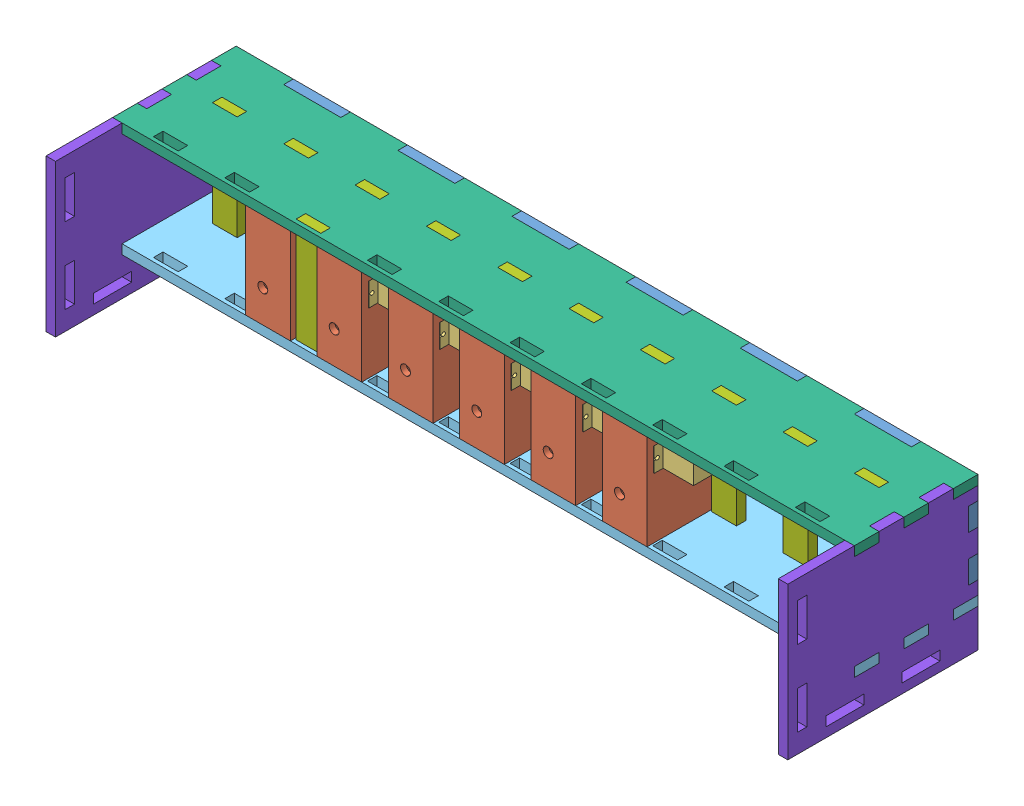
SolidWorks assembly A_SupportDistributeur.SLDASM, configuration Défaut (file format 10000). Lengths in mm.
Overall size (390 80 100).
40 component instances, 8 part files, 62 mates.
Components (placement in the parent):
- BaseSupport-1: BaseSupport.SLDPRT [Défaut] at (-173.4428 -0.6213 387.5) size (390 60 5)
- A_Distributeur-1: A_Distributeur.SLDASM [Défaut] at (-82.4428 -5.6213 392.5) x (0 0 1) z (0 -1 0) size (60 39.4 50)
  - case-2: case.SLDPRT [Défaut] at origin size (60 23.5 50)
  - servo-3: servo.SLDPRT [Predeterminado] at (40 -18.4 5.85) size (32.6 27 12.6)
  - escargot-1: escargot.SLDPRT [Défaut] at (34.8 8.6 12.15) x (0.387649 0 -0.921807) z (0.921807 0 0.387649) size (25.16 8.5 15.4)
- A_Distributeur-2: A_Distributeur.SLDASM [Défaut] at (-44.9428 -5.6213 392.5) x (0 0 1) z (0 -1 0) size (60 39.4 50)
  - case-2: case.SLDPRT [Défaut] at origin size (60 23.5 50)
  - servo-3: servo.SLDPRT [Predeterminado] at (40 -18.4 5.85) size (32.6 27 12.6)
  - escargot-1: escargot.SLDPRT [Défaut] at (34.8 8.6 12.15) x (0.387649 0 -0.921807) z (0.921807 0 0.387649) size (25.16 8.5 15.4)
- A_Distributeur-3: A_Distributeur.SLDASM [Défaut] at (-7.4428 -5.6213 392.5) x (0 0 1) z (0 -1 0) size (60 39.4 50)
  - case-2: case.SLDPRT [Défaut] at origin size (60 23.5 50)
  - servo-3: servo.SLDPRT [Predeterminado] at (40 -18.4 5.85) size (32.6 27 12.6)
  - escargot-1: escargot.SLDPRT [Défaut] at (34.8 8.6 12.15) x (0.387649 0 -0.921807) z (0.921807 0 0.387649) size (25.16 8.5 15.4)
- A_Distributeur-4: A_Distributeur.SLDASM [Défaut] at (30.0572 -5.6213 392.5) x (0 0 1) z (0 -1 0) size (60 39.4 50)
  - case-2: case.SLDPRT [Défaut] at origin size (60 23.5 50)
  - servo-3: servo.SLDPRT [Predeterminado] at (40 -18.4 5.85) size (32.6 27 12.6)
  - escargot-1: escargot.SLDPRT [Défaut] at (34.8 8.6 12.15) x (0.387649 0 -0.921807) z (0.921807 0 0.387649) size (25.16 8.5 15.4)
- A_Distributeur-5: A_Distributeur.SLDASM [Défaut] at (67.5572 -5.6213 392.5) x (0 0 1) z (0 -1 0) size (60 39.4 50)
  - case-2: case.SLDPRT [Défaut] at origin size (60 23.5 50)
  - servo-3: servo.SLDPRT [Predeterminado] at (40 -18.4 5.85) size (32.6 27 12.6)
  - escargot-1: escargot.SLDPRT [Défaut] at (34.8 8.6 12.15) x (0.387649 0 -0.921807) z (0.921807 0 0.387649) size (25.16 8.5 15.4)
- A_Distributeur-6: A_Distributeur.SLDASM [Défaut] at (105.0572 -5.6213 392.5) x (0 0 1) z (0 -1 0) size (60 39.4 50)
  - case-2: case.SLDPRT [Défaut] at origin size (60 23.5 50)
  - servo-3: servo.SLDPRT [Predeterminado] at (40 -18.4 5.85) size (32.6 27 12.6)
  - escargot-1: escargot.SLDPRT [Défaut] at (34.8 8.6 12.15) x (0.387649 0 -0.921807) z (0.921807 0 0.387649) size (25.16 8.5 15.4)
- FrontSupport-1: FrontSupport.SLDPRT [Défaut] at (-173.4428 -55.6213 452.5) x (1 0 0) z (0 -1 0) size (390 65 5)
- BackSupport-1: BackSupport.SLDPRT [Défaut] at (-173.4428 -0.6213 452.5) x (1 0 0) z (0 -1 0) size (390 65 5)
- BlockDistributeur-1: BlockDistributeur.SLDPRT [Défaut] at (-140.9428 -0.6213 414.5) x (-1 0 0) z (0 -1 0) size (13 5 60)
- BlockDistributeur-2: BlockDistributeur.SLDPRT [Défaut] at (-103.4428 -0.6213 414.5) x (-1 0 0) z (0 -1 0) size (13 5 60)
- BlockDistributeur-3: BlockDistributeur.SLDPRT [Défaut] at (-65.9428 -0.6213 414.5) x (-1 0 0) z (0 -1 0) size (13 5 60)
- BlockDistributeur-4: BlockDistributeur.SLDPRT [Défaut] at (-28.4428 -0.6213 414.5) x (-1 0 0) z (0 -1 0) size (13 5 60)
- BlockDistributeur-5: BlockDistributeur.SLDPRT [Défaut] at (9.0572 -0.6213 414.5) x (-1 0 0) z (0 -1 0) size (13 5 60)
- BlockDistributeur-6: BlockDistributeur.SLDPRT [Défaut] at (46.5572 -0.6213 414.5) x (-1 0 0) z (0 -1 0) size (13 5 60)
- BlockDistributeur-7: BlockDistributeur.SLDPRT [Défaut] at (84.0572 -0.6213 414.5) x (-1 0 0) z (0 -1 0) size (13 5 60)
- BlockDistributeur-8: BlockDistributeur.SLDPRT [Défaut] at (121.5572 -0.6213 414.5) x (-1 0 0) z (0 -1 0) size (13 5 60)
- BlockDistributeur-9: BlockDistributeur.SLDPRT [Défaut] at (159.0572 -0.6213 414.5) x (-1 0 0) z (0 -1 0) size (13 5 60)
- BlockDistributeur-10: BlockDistributeur.SLDPRT [Défaut] at (196.5572 -0.6213 414.5) x (-1 0 0) z (0 -1 0) size (13 5 60)
- LeftSupport-1: LeftSupport.SLDPRT [Défaut] at (-168.4428 -0.6213 452.5) x (-1 0 0) z (0 1 0) size (5 100 80)
- LeftSupport-2: LeftSupport.SLDPRT [Défaut] at (216.5572 -0.6213 452.5) x (-1 0 0) z (0 1 0) size (5 100 80)
- BlockDistributeur-11: BlockDistributeur.SLDPRT [Défaut] at (-65.9428 -0.6213 445.5) x (-1 0 0) z (0 -1 0) size (13 5 60)
Mates (geometry in assembly coordinates):
- Coïncidente4: coincident anti-aligned: plane of BaseSupport-1 through (-173.4428 -0.6213 392.5) normal (0 0 1); plane of A_Distributeur-1/case-2 through (-103.4428 -5.6213 392.5) normal (0 0 -1)
- Coïncidente6: coincident anti-aligned: plane of BaseSupport-1 through (-173.4428 -0.6213 392.5) normal (0 0 1); plane of A_Distributeur-2/case-2 through (-65.9428 -5.6213 392.5) normal (0 0 -1)
- Coïncidente8: coincident anti-aligned: plane of BaseSupport-1 through (-173.4428 -0.6213 392.5) normal (0 0 1); plane of A_Distributeur-3/case-2 through (-28.4428 -5.6213 392.5) normal (0 0 -1)
- Coïncidente14: coincident anti-aligned: plane of BaseSupport-1 through (-173.4428 -0.6213 392.5) normal (0 0 1); plane of A_Distributeur-4/case-2 through (9.0572 -5.6213 392.5) normal (0 0 -1)
- Coïncidente15: coincident anti-aligned: plane of BaseSupport-1 through (-173.4428 -0.6213 392.5) normal (0 0 1); plane of A_Distributeur-5/case-2 through (46.5572 -5.6213 392.5) normal (0 0 -1)
- Coïncidente16: coincident anti-aligned: plane of BaseSupport-1 through (-173.4428 -0.6213 392.5) normal (0 0 1); plane of A_Distributeur-6/case-2 through (84.0572 -5.6213 392.5) normal (0 0 -1)
- Distance1: distance = 2 mm anti-aligned: plane of A_Distributeur-2/escargot-1 through (-62.0428 -17.7713 427.3) normal (-1 0 0); plane of A_Distributeur-1/servo-3 through (-64.0428 -24.0713 444) normal (1 0 0)
- Distance2: distance = 2 mm anti-aligned: plane of A_Distributeur-2/servo-3 through (-26.5428 -24.0713 444) normal (1 0 0); plane of A_Distributeur-3/escargot-1 through (-24.5428 -17.7713 427.3) normal (-1 0 0)
- Distance3: distance = 2 mm anti-aligned: plane of A_Distributeur-4/escargot-1 through (12.9572 -17.7713 427.3) normal (-1 0 0); plane of A_Distributeur-3/servo-3 through (10.9572 -24.0713 444) normal (1 0 0)
- Distance4: distance = 2 mm anti-aligned: plane of A_Distributeur-5/escargot-1 through (50.4572 -17.7713 427.3) normal (-1 0 0); plane of A_Distributeur-4/servo-3 through (48.4572 -24.0713 444) normal (1 0 0)
- Distance5: distance = 2 mm anti-aligned: plane of A_Distributeur-6/escargot-1 through (87.9572 -17.7713 427.3) normal (-1 0 0); plane of A_Distributeur-5/servo-3 through (85.9572 -24.0713 444) normal (1 0 0)
- Distance6: distance = 70 mm aligned: plane of A_Distributeur-1/case-2 through (-103.4428 -5.6213 392.5) normal (-1 0 0); plane of BaseSupport-1 through (-173.4428 -0.6213 392.5) normal (-1 0 0)
- Coïncidente23: coincident aligned: plane of BaseSupport-1 through (-113.4428 -55.6213 387.5) normal (0 -1 0); plane of A_Distributeur-1/case-2 through (-103.4428 -55.6213 392.5) normal (0 -1 0)
- Coïncidente24: coincident aligned: plane of BaseSupport-1 through (-53.4428 -55.6213 387.5) normal (0 -1 0); plane of A_Distributeur-2/case-2 through (-65.9428 -55.6213 392.5) normal (0 -1 0)
- Coïncidente25: coincident aligned: plane of BaseSupport-1 through (-53.4428 -55.6213 387.5) normal (0 -1 0); plane of A_Distributeur-3/case-2 through (-28.4428 -55.6213 392.5) normal (0 -1 0)
- Coïncidente28: coincident aligned: plane of BaseSupport-1 through (6.5572 -55.6213 387.5) normal (0 -1 0); plane of A_Distributeur-4/case-2 through (9.0572 -55.6213 392.5) normal (0 -1 0)
- Coïncidente29: coincident aligned: plane of BaseSupport-1 through (66.5572 -55.6213 387.5) normal (0 -1 0); plane of A_Distributeur-5/case-2 through (46.5572 -55.6213 392.5) normal (0 -1 0)
- Coïncidente30: coincident aligned: plane of BaseSupport-1 through (66.5572 -55.6213 387.5) normal (0 -1 0); plane of A_Distributeur-6/case-2 through (84.0572 -55.6213 392.5) normal (0 -1 0)
- Coïncidente31: coincident aligned: plane of BaseSupport-1 through (-173.4428 -60.6213 392.5) normal (0 -1 0); plane of FrontSupport-1 through (-173.4428 -60.6213 452.5) normal (0 -1 0)
- Coïncidente32: coincident aligned: plane of BaseSupport-1 through (-173.4428 -0.6213 387.5) normal (0 0 -1); plane of FrontSupport-1 through (-173.4428 -60.6213 387.5) normal (0 0 -1)
- Coïncidente33: coincident aligned: plane of BaseSupport-1 through (-173.4428 -0.6213 392.5) normal (-1 0 0); plane of FrontSupport-1 through (-173.4428 -60.6213 452.5) normal (-1 0 0)
- Coïncidente34: coincident anti-aligned: plane of BaseSupport-1 through (-113.4428 -5.6213 387.5) normal (0 1 0); plane of BackSupport-1 through (-173.4428 -5.6213 452.5) normal (0 -1 0)
- Coïncidente35: coincident aligned: plane of BaseSupport-1 through (-173.4428 -0.6213 392.5) normal (-1 0 0); plane of BackSupport-1 through (-173.4428 -5.6213 452.5) normal (-1 0 0)
- Coïncidente36: coincident aligned: plane of BaseSupport-1 through (-173.4428 -0.6213 387.5) normal (0 0 -1); plane of BackSupport-1 through (-173.4428 -5.6213 387.5) normal (0 0 -1)
- Coïncidente37: coincident aligned: plane of FrontSupport-1 through (-173.4428 -60.6213 452.5) normal (0 -1 0); plane of BlockDistributeur-1 through (-140.9428 -60.6213 414.5) normal (0 -1 0)
- Coïncidente38: coincident anti-aligned: plane of BackSupport-1 through (-153.9428 -0.6213 419.5) normal (0 0 -1); plane of BlockDistributeur-1 through (-140.9428 -60.6213 419.5) normal (0 0 1)
- Coïncidente39: coincident anti-aligned: plane of BackSupport-1 through (-153.9428 -0.6213 419.5) normal (1 0 0); plane of BlockDistributeur-1 through (-153.9428 -60.6213 414.5) normal (-1 0 0)
- Coïncidente40: coincident aligned: plane of FrontSupport-1 through (-173.4428 -60.6213 452.5) normal (0 -1 0); plane of BlockDistributeur-2 through (-103.4428 -60.6213 414.5) normal (0 -1 0)
- Coïncidente41: coincident aligned: plane of FrontSupport-1 through (-173.4428 -60.6213 452.5) normal (0 -1 0); plane of BlockDistributeur-3 through (-65.9428 -60.6213 414.5) normal (0 -1 0)
- Coïncidente42: coincident aligned: plane of FrontSupport-1 through (-173.4428 -60.6213 452.5) normal (0 -1 0); plane of BlockDistributeur-4 through (-28.4428 -60.6213 414.5) normal (0 -1 0)
- Coïncidente43: coincident aligned: plane of FrontSupport-1 through (-173.4428 -60.6213 452.5) normal (0 -1 0); plane of BlockDistributeur-5 through (9.0572 -60.6213 414.5) normal (0 -1 0)
- Coïncidente44: coincident aligned: plane of FrontSupport-1 through (-173.4428 -60.6213 452.5) normal (0 -1 0); plane of BlockDistributeur-6 through (46.5572 -60.6213 414.5) normal (0 -1 0)
- Coïncidente45: coincident aligned: plane of FrontSupport-1 through (-173.4428 -60.6213 452.5) normal (0 -1 0); plane of BlockDistributeur-7 through (84.0572 -60.6213 414.5) normal (0 -1 0)
- Coïncidente46: coincident aligned: plane of FrontSupport-1 through (-173.4428 -60.6213 452.5) normal (0 -1 0); plane of BlockDistributeur-8 through (121.5572 -60.6213 414.5) normal (0 -1 0)
- Coïncidente47: coincident aligned: plane of FrontSupport-1 through (-173.4428 -60.6213 452.5) normal (0 -1 0); plane of BlockDistributeur-9 through (159.0572 -60.6213 414.5) normal (0 -1 0)
- Coïncidente48: coincident aligned: plane of FrontSupport-1 through (-173.4428 -60.6213 452.5) normal (0 -1 0); plane of BlockDistributeur-10 through (196.5572 -60.6213 414.5) normal (0 -1 0)
- Coïncidente49: coincident anti-aligned: plane of FrontSupport-1 through (-116.4428 -55.6213 419.5) normal (1 0 0); plane of BlockDistributeur-2 through (-116.4428 -60.6213 414.5) normal (-1 0 0)
- Coïncidente50: coincident anti-aligned: plane of FrontSupport-1 through (-116.4428 -55.6213 414.5) normal (0 0 1); plane of BlockDistributeur-2 through (-103.4428 -60.6213 414.5) normal (0 0 -1)
- Coïncidente51: coincident anti-aligned: plane of FrontSupport-1 through (-78.9428 -55.6213 419.5) normal (0 0 -1); plane of BlockDistributeur-3 through (-65.9428 -60.6213 419.5) normal (0 0 1)
- Coïncidente52: coincident anti-aligned: plane of FrontSupport-1 through (-78.9428 -55.6213 419.5) normal (1 0 0); plane of BlockDistributeur-3 through (-78.9428 -60.6213 414.5) normal (-1 0 0)
- Coïncidente53: coincident anti-aligned: plane of FrontSupport-1 through (-41.4428 -55.6213 419.5) normal (0 0 -1); plane of BlockDistributeur-4 through (-28.4428 -60.6213 419.5) normal (0 0 1)
- Coïncidente54: coincident anti-aligned: plane of FrontSupport-1 through (-28.4428 -55.6213 419.5) normal (-1 0 0); plane of BlockDistributeur-4 through (-28.4428 -60.6213 414.5) normal (1 0 0)
- Coïncidente55: coincident anti-aligned: plane of FrontSupport-1 through (-3.9428 -55.6213 419.5) normal (0 0 -1); plane of BlockDistributeur-5 through (9.0572 -60.6213 419.5) normal (0 0 1)
- Coïncidente56: coincident anti-aligned: plane of FrontSupport-1 through (9.0572 -55.6213 419.5) normal (-1 0 0); plane of BlockDistributeur-5 through (9.0572 -60.6213 414.5) normal (1 0 0)
- Coïncidente57: coincident: line of FrontSupport-1 through (46.5572 -55.6213 419.5) axis (-1 0 0); plane of BlockDistributeur-6 through (46.5572 -60.6213 419.5) normal (0 0 1)
- Coïncidente58: coincident anti-aligned: plane of FrontSupport-1 through (46.5572 -55.6213 419.5) normal (-1 0 0); plane of BlockDistributeur-6 through (46.5572 -60.6213 414.5) normal (1 0 0)
- Coïncidente59: coincident anti-aligned: plane of FrontSupport-1 through (71.0572 -55.6213 419.5) normal (0 0 -1); plane of BlockDistributeur-7 through (84.0572 -60.6213 419.5) normal (0 0 1)
- Coïncidente60: coincident anti-aligned: plane of FrontSupport-1 through (84.0572 -55.6213 419.5) normal (-1 0 0); plane of BlockDistributeur-7 through (84.0572 -60.6213 414.5) normal (1 0 0)
- Coïncidente61: coincident anti-aligned: plane of FrontSupport-1 through (108.5572 -55.6213 419.5) normal (0 0 -1); plane of BlockDistributeur-8 through (121.5572 -60.6213 419.5) normal (0 0 1)
- Coïncidente62: coincident anti-aligned: plane of FrontSupport-1 through (121.5572 -55.6213 419.5) normal (-1 0 0); plane of BlockDistributeur-8 through (121.5572 -60.6213 414.5) normal (1 0 0)
- Coïncidente63: coincident anti-aligned: plane of FrontSupport-1 through (146.0572 -55.6213 419.5) normal (0 0 -1); plane of BlockDistributeur-9 through (159.0572 -60.6213 419.5) normal (0 0 1)
- Coïncidente64: coincident anti-aligned: plane of FrontSupport-1 through (159.0572 -55.6213 419.5) normal (-1 0 0); plane of BlockDistributeur-9 through (159.0572 -60.6213 414.5) normal (1 0 0)
- Coïncidente65: coincident anti-aligned: plane of FrontSupport-1 through (183.5572 -55.6213 419.5) normal (0 0 -1); plane of BlockDistributeur-10 through (196.5572 -60.6213 419.5) normal (0 0 1)
- Coïncidente66: coincident anti-aligned: plane of FrontSupport-1 through (196.5572 -55.6213 419.5) normal (-1 0 0); plane of BlockDistributeur-10 through (196.5572 -60.6213 414.5) normal (1 0 0)
- Coïncidente67: coincident aligned: plane of BaseSupport-1 through (-173.4428 -0.6213 387.5) normal (0 0 -1); plane of LeftSupport-1 through (-173.4428 -0.6213 387.5) normal (0 0 -1)
- Coïncidente68: coincident aligned: plane of BackSupport-1 through (-173.4428 -0.6213 452.5) normal (0 1 0); plane of LeftSupport-1 through (-173.4428 -0.6213 452.5) normal (0 1 0)
- Coïncidente69: coincident aligned: plane of BaseSupport-1 through (-173.4428 -0.6213 392.5) normal (-1 0 0); plane of LeftSupport-1 through (-173.4428 -0.6213 452.5) normal (-1 0 0)
- Coïncidente71: coincident aligned: plane of BaseSupport-1 through (-173.4428 -0.6213 387.5) normal (0 0 -1); plane of LeftSupport-2 through (211.5572 -0.6213 387.5) normal (0 0 -1)
- Coïncidente72: coincident aligned: plane of BackSupport-1 through (216.5572 -5.6213 452.5) normal (1 0 0); plane of LeftSupport-2 through (216.5572 -0.6213 452.5) normal (1 0 0)
- Coïncidente73: coincident aligned: plane of FrontSupport-1 through (-173.4428 -60.6213 452.5) normal (0 -1 0); plane of BlockDistributeur-11 through (-65.9428 -60.6213 445.5) normal (0 -1 0)
- Coïncidente74: coincident anti-aligned: plane of BackSupport-1 through (-78.9428 -0.6213 445.5) normal (0 0 1); plane of BlockDistributeur-11 through (-65.9428 -60.6213 445.5) normal (0 0 -1)
- Coïncidente75: coincident anti-aligned: plane of BackSupport-1 through (-65.9428 -0.6213 450.5) normal (-1 0 0); plane of BlockDistributeur-11 through (-65.9428 -60.6213 445.5) normal (1 0 0)
